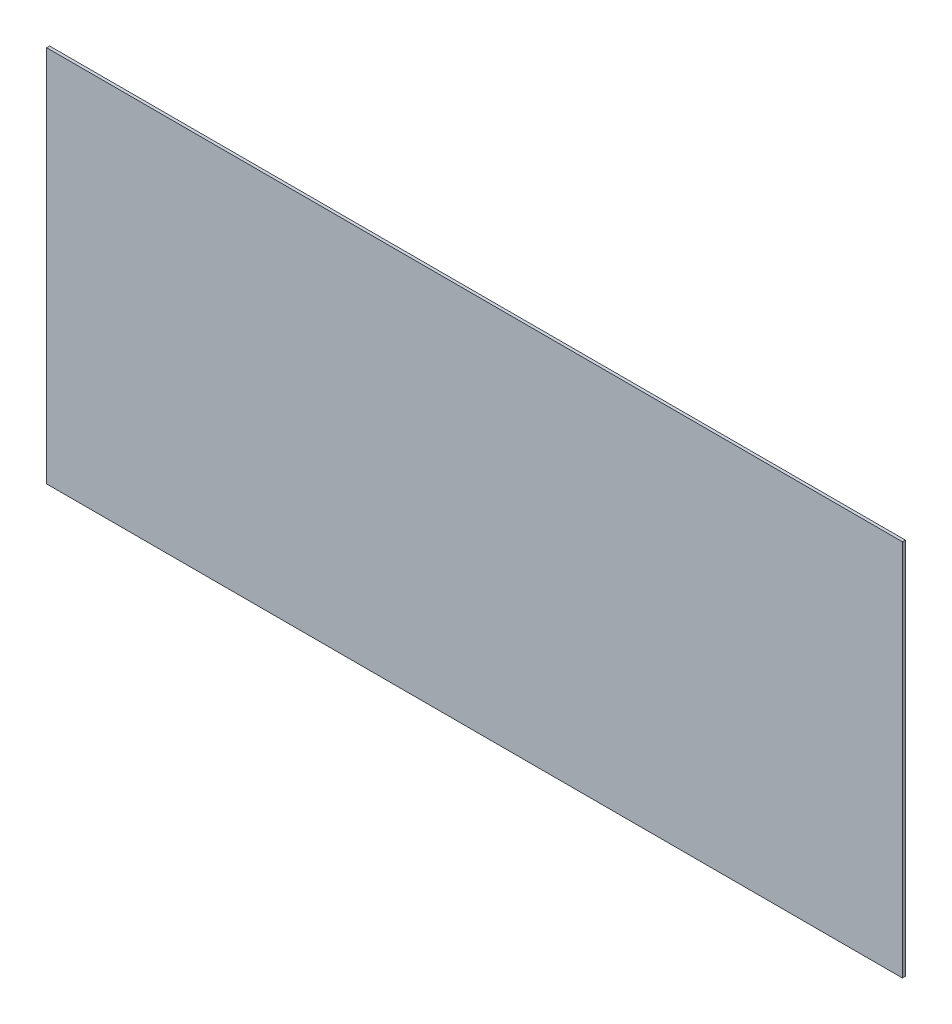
ISO-10303-21;
HEADER;
FILE_DESCRIPTION(('STEP AP214'),'2;1');
FILE_NAME('part.step','',(''),(''),'','','');
FILE_SCHEMA(('AUTOMOTIVE_DESIGN { 1 0 10303 214 1 1 1 1 }'));
ENDSEC;
DATA;
#1=APPLICATION_CONTEXT('core data for automotive mechanical design processes');
#2=APPLICATION_PROTOCOL_DEFINITION('international standard','automotive_design',2000,#1);
#3=PRODUCT_CONTEXT('',#1,'mechanical');
#4=PRODUCT('Part','Part','',(#3));
#5=PRODUCT_RELATED_PRODUCT_CATEGORY('part','',(#4));
#6=PRODUCT_DEFINITION_FORMATION('','',#4);
#7=PRODUCT_DEFINITION_CONTEXT('part definition',#1,'design');
#8=PRODUCT_DEFINITION('design','',#6,#7);
#9=PRODUCT_DEFINITION_SHAPE('','',#8);
#10=(LENGTH_UNIT() NAMED_UNIT(*) SI_UNIT(.MILLI.,.METRE.));
#11=(NAMED_UNIT(*) PLANE_ANGLE_UNIT() SI_UNIT($,.RADIAN.));
#12=(NAMED_UNIT(*) SI_UNIT($,.STERADIAN.) SOLID_ANGLE_UNIT());
#13=UNCERTAINTY_MEASURE_WITH_UNIT(LENGTH_MEASURE(1.E-05),#10,'distance_accuracy_value','');
#14=(GEOMETRIC_REPRESENTATION_CONTEXT(3) GLOBAL_UNCERTAINTY_ASSIGNED_CONTEXT((#13)) GLOBAL_UNIT_ASSIGNED_CONTEXT((#10,
#11,#12)) REPRESENTATION_CONTEXT('',''));
#15=CARTESIAN_POINT('',(0.,0.,0.));
#16=DIRECTION('',(0.,0.,1.));
#17=DIRECTION('',(1.,0.,0.));
#18=AXIS2_PLACEMENT_3D('',#15,#16,#17);
#19=CARTESIAN_POINT('',(-135.,3406.40660572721,3.));
#20=DIRECTION('',(1.,0.,0.));
#21=DIRECTION('',(0.,0.,-1.));
#22=AXIS2_PLACEMENT_3D('',#19,#20,#21);
#23=PLANE('',#22);
#24=DIRECTION('',(0.,-1.,0.));
#25=VECTOR('',#24,1.);
#26=CARTESIAN_POINT('',(-135.,3406.40660572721,0.));
#27=LINE('',#26,#25);
#28=CARTESIAN_POINT('',(-135.,3791.12353197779,0.));
#29=VERTEX_POINT('',#28);
#30=CARTESIAN_POINT('',(-135.,3406.40660572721,0.));
#31=VERTEX_POINT('',#30);
#32=EDGE_CURVE('E70',#29,#31,#27,.T.);
#33=ORIENTED_EDGE('',*,*,#32,.T.);
#34=DIRECTION('',(0.,0.,-1.));
#35=VECTOR('',#34,1.);
#36=CARTESIAN_POINT('',(-135.,3406.40660572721,3.));
#37=LINE('',#36,#35);
#38=CARTESIAN_POINT('',(-135.,3406.40660572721,3.));
#39=VERTEX_POINT('',#38);
#40=EDGE_CURVE('E11',#39,#31,#37,.T.);
#41=ORIENTED_EDGE('',*,*,#40,.F.);
#42=DIRECTION('',(0.,-1.,0.));
#43=VECTOR('',#42,1.);
#44=CARTESIAN_POINT('',(-135.,3406.40660572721,3.));
#45=LINE('',#44,#43);
#46=CARTESIAN_POINT('',(-135.,3791.12353197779,3.));
#47=VERTEX_POINT('',#46);
#48=EDGE_CURVE('E88',#47,#39,#45,.T.);
#49=ORIENTED_EDGE('',*,*,#48,.F.);
#50=DIRECTION('',(0.,0.,-1.));
#51=VECTOR('',#50,1.);
#52=CARTESIAN_POINT('',(-135.,3791.12353197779,3.));
#53=LINE('',#52,#51);
#54=EDGE_CURVE('E82',#47,#29,#53,.T.);
#55=ORIENTED_EDGE('',*,*,#54,.T.);
#56=EDGE_LOOP('',(#33,#41,#49,#55));
#57=FACE_BOUND('',#56,.T.);
#58=ADVANCED_FACE('F26',(#57),#23,.F.);
#59=CARTESIAN_POINT('',(-135.,3406.40660572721,3.));
#60=DIRECTION('',(0.,1.,0.));
#61=DIRECTION('',(0.,0.,1.));
#62=AXIS2_PLACEMENT_3D('',#59,#60,#61);
#63=PLANE('',#62);
#64=DIRECTION('',(1.,0.,0.));
#65=VECTOR('',#64,1.);
#66=CARTESIAN_POINT('',(-135.,3406.40660572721,0.));
#67=LINE('',#66,#65);
#68=CARTESIAN_POINT('',(736.44304018,3406.40660572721,0.));
#69=VERTEX_POINT('',#68);
#70=EDGE_CURVE('E66',#31,#69,#67,.T.);
#71=ORIENTED_EDGE('',*,*,#70,.T.);
#72=DIRECTION('',(0.,0.,-1.));
#73=VECTOR('',#72,1.);
#74=CARTESIAN_POINT('',(736.44304018,3406.40660572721,3.));
#75=LINE('',#74,#73);
#76=CARTESIAN_POINT('',(736.44304018,3406.40660572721,3.));
#77=VERTEX_POINT('',#76);
#78=EDGE_CURVE('E33',#77,#69,#75,.T.);
#79=ORIENTED_EDGE('',*,*,#78,.F.);
#80=DIRECTION('',(1.,0.,0.));
#81=VECTOR('',#80,1.);
#82=CARTESIAN_POINT('',(-135.,3406.40660572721,3.));
#83=LINE('',#82,#81);
#84=EDGE_CURVE('E78',#39,#77,#83,.T.);
#85=ORIENTED_EDGE('',*,*,#84,.F.);
#86=ORIENTED_EDGE('',*,*,#40,.T.);
#87=EDGE_LOOP('',(#71,#79,#85,#86));
#88=FACE_BOUND('',#87,.T.);
#89=ADVANCED_FACE('F77',(#88),#63,.F.);
#90=CARTESIAN_POINT('',(736.44304018,3406.40660572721,3.));
#91=DIRECTION('',(-1.,0.,0.));
#92=DIRECTION('',(0.,0.,1.));
#93=AXIS2_PLACEMENT_3D('',#90,#91,#92);
#94=PLANE('',#93);
#95=DIRECTION('',(0.,1.,0.));
#96=VECTOR('',#95,1.);
#97=CARTESIAN_POINT('',(736.44304018,3406.40660572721,0.));
#98=LINE('',#97,#96);
#99=CARTESIAN_POINT('',(736.44304018,3791.12353197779,0.));
#100=VERTEX_POINT('',#99);
#101=EDGE_CURVE('E71',#69,#100,#98,.T.);
#102=ORIENTED_EDGE('',*,*,#101,.T.);
#103=DIRECTION('',(0.,0.,-1.));
#104=VECTOR('',#103,1.);
#105=CARTESIAN_POINT('',(736.44304018,3791.12353197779,3.));
#106=LINE('',#105,#104);
#107=CARTESIAN_POINT('',(736.44304018,3791.12353197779,3.));
#108=VERTEX_POINT('',#107);
#109=EDGE_CURVE('E94',#108,#100,#106,.T.);
#110=ORIENTED_EDGE('',*,*,#109,.F.);
#111=DIRECTION('',(0.,1.,0.));
#112=VECTOR('',#111,1.);
#113=CARTESIAN_POINT('',(736.44304018,3406.40660572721,3.));
#114=LINE('',#113,#112);
#115=EDGE_CURVE('E45',#77,#108,#114,.T.);
#116=ORIENTED_EDGE('',*,*,#115,.F.);
#117=ORIENTED_EDGE('',*,*,#78,.T.);
#118=EDGE_LOOP('',(#102,#110,#116,#117));
#119=FACE_BOUND('',#118,.T.);
#120=ADVANCED_FACE('F97',(#119),#94,.F.);
#121=CARTESIAN_POINT('',(-135.,3791.12353197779,3.));
#122=DIRECTION('',(0.,-1.,0.));
#123=DIRECTION('',(0.,0.,-1.));
#124=AXIS2_PLACEMENT_3D('',#121,#122,#123);
#125=PLANE('',#124);
#126=DIRECTION('',(-1.,0.,0.));
#127=VECTOR('',#126,1.);
#128=CARTESIAN_POINT('',(-135.,3791.12353197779,0.));
#129=LINE('',#128,#127);
#130=EDGE_CURVE('E86',#100,#29,#129,.T.);
#131=ORIENTED_EDGE('',*,*,#130,.T.);
#132=ORIENTED_EDGE('',*,*,#54,.F.);
#133=DIRECTION('',(-1.,0.,0.));
#134=VECTOR('',#133,1.);
#135=CARTESIAN_POINT('',(-135.,3791.12353197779,3.));
#136=LINE('',#135,#134);
#137=EDGE_CURVE('E40',#108,#47,#136,.T.);
#138=ORIENTED_EDGE('',*,*,#137,.F.);
#139=ORIENTED_EDGE('',*,*,#109,.T.);
#140=EDGE_LOOP('',(#131,#132,#138,#139));
#141=FACE_BOUND('',#140,.T.);
#142=ADVANCED_FACE('F99',(#141),#125,.F.);
#143=CARTESIAN_POINT('',(-135.,3791.12353197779,3.));
#144=DIRECTION('',(0.,0.,-1.));
#145=DIRECTION('',(-1.,0.,0.));
#146=AXIS2_PLACEMENT_3D('',#143,#144,#145);
#147=PLANE('',#146);
#148=ORIENTED_EDGE('',*,*,#48,.T.);
#149=ORIENTED_EDGE('',*,*,#84,.T.);
#150=ORIENTED_EDGE('',*,*,#115,.T.);
#151=ORIENTED_EDGE('',*,*,#137,.T.);
#152=EDGE_LOOP('',(#148,#149,#150,#151));
#153=FACE_BOUND('',#152,.T.);
#154=ADVANCED_FACE('F100',(#153),#147,.F.);
#155=CARTESIAN_POINT('',(-135.,3791.12353197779,0.));
#156=DIRECTION('',(0.,0.,-1.));
#157=DIRECTION('',(-1.,0.,0.));
#158=AXIS2_PLACEMENT_3D('',#155,#156,#157);
#159=PLANE('',#158);
#160=ORIENTED_EDGE('',*,*,#32,.F.);
#161=ORIENTED_EDGE('',*,*,#130,.F.);
#162=ORIENTED_EDGE('',*,*,#101,.F.);
#163=ORIENTED_EDGE('',*,*,#70,.F.);
#164=EDGE_LOOP('',(#160,#161,#162,#163));
#165=FACE_BOUND('',#164,.T.);
#166=ADVANCED_FACE('F67',(#165),#159,.T.);
#167=CLOSED_SHELL('',(#58,#89,#120,#142,#154,#166));
#168=MANIFOLD_SOLID_BREP('B2',#167);
#169=ADVANCED_BREP_SHAPE_REPRESENTATION('',(#18,#168),#14);
#170=SHAPE_DEFINITION_REPRESENTATION(#9,#169);
ENDSEC;
END-ISO-10303-21;
